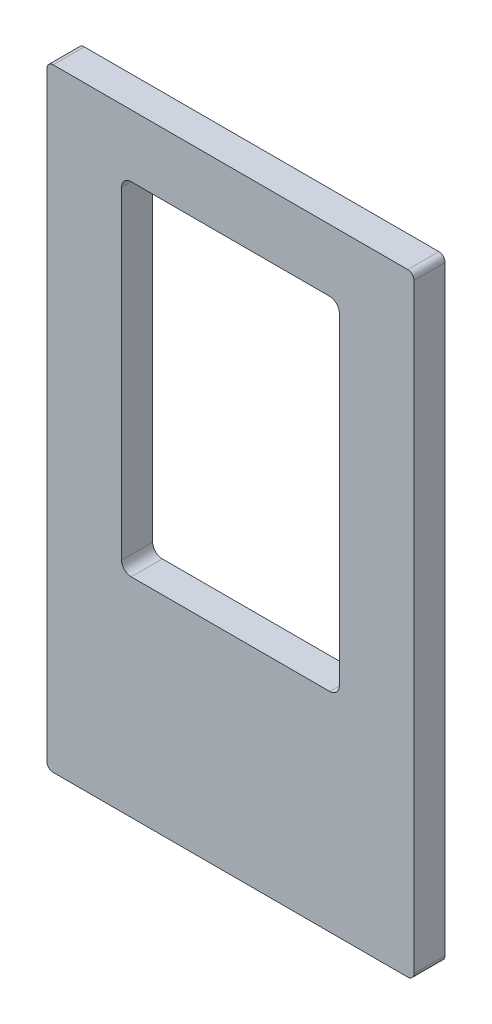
from build123d import *

# Parameters (mm, degrees)
BOSS_EXTRU_1_DEPTH      = 10
ENL_V_MAT_EXTRU_1_DEPTH = 165.599655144


with BuildPart() as part:
    # Esquisse2 → Boss.-Extru.1 (new body)
    with BuildSketch(Plane.XY):
        with BuildLine():
            Line((-71.564965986, 146.905555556), (42.435034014, 146.905555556))
            ThreePointArc((42.435034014, 146.905555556), (43.849247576, 146.319769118), (44.435034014, 144.905555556))
            Line((44.435034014, 144.905555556), (44.435034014, -48.094444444))
            ThreePointArc((44.435034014, -48.094444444), (43.849247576, -49.508658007), (42.435034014, -50.094444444))
            Line((42.435034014, -50.094444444), (-71.564965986, -50.094444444))
            ThreePointArc((-71.564965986, -50.094444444), (-72.979179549, -49.508658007), (-73.564965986, -48.094444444))
            Line((-73.564965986, -48.094444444), (-73.564965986, 144.905555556))
            ThreePointArc((-73.564965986, 144.905555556), (-72.979179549, 146.319769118), (-71.564965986, 146.905555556))
        make_face()
    extrude(amount=BOSS_EXTRU_1_DEPTH)

    # Esquisse3 → Enl_v. mat.-Extru.1 (cut, through all)
    with BuildSketch(Plane(origin=(0, 0, 0), x_dir=(-1, 0, 0), z_dir=(0, 0, -1))):
        with BuildLine():
            Line((-17.335034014, 126.905555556), (46.464965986, 126.905555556))
            ThreePointArc((46.464965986, 126.905555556), (48.656997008, 125.997586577), (49.564965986, 123.805555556))
            Line((49.564965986, 123.805555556), (49.564965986, 20.005555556))
            ThreePointArc((49.564965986, 20.005555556), (48.656997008, 17.813524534), (46.464965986, 16.905555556))
            Line((46.464965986, 16.905555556), (-17.335034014, 16.905555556))
            ThreePointArc((-17.335034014, 16.905555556), (-19.527065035, 17.813524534), (-20.435034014, 20.005555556))
            Line((-20.435034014, 20.005555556), (-20.435034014, 123.805555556))
            ThreePointArc((-20.435034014, 123.805555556), (-19.527065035, 125.997586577), (-17.335034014, 126.905555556))
        make_face()
    extrude(amount=-ENL_V_MAT_EXTRU_1_DEPTH, mode=Mode.SUBTRACT)


solid = part.part
